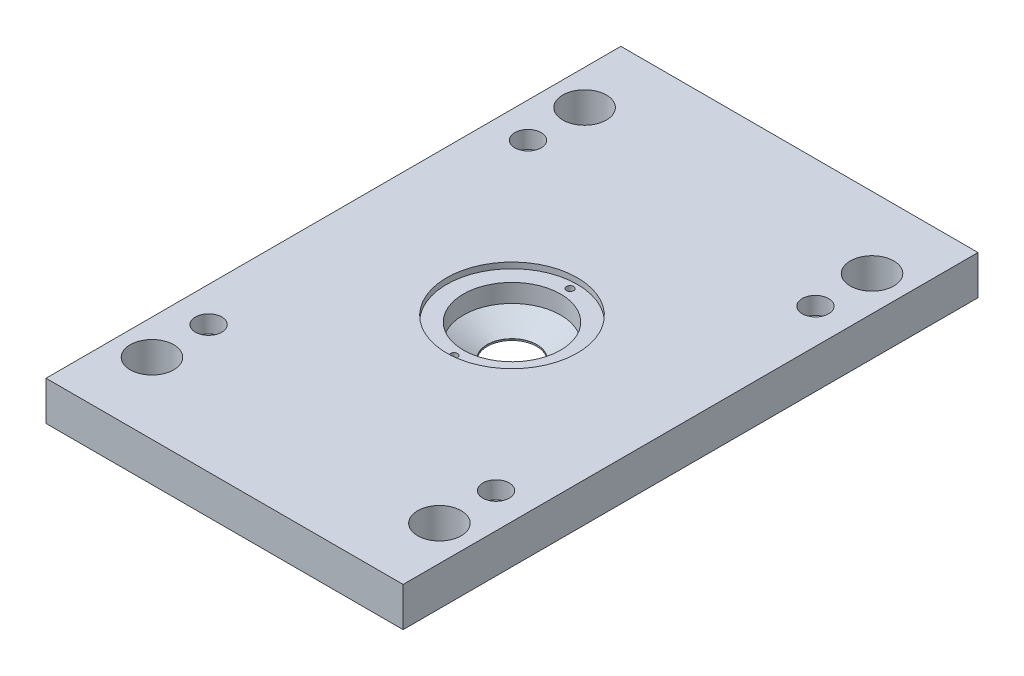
ISO-10303-21;
HEADER;
FILE_DESCRIPTION(('STEP AP214'),'2;1');
FILE_NAME('part.step','',(''),(''),'','','');
FILE_SCHEMA(('AUTOMOTIVE_DESIGN { 1 0 10303 214 1 1 1 1 }'));
ENDSEC;
DATA;
#1=APPLICATION_CONTEXT('core data for automotive mechanical design processes');
#2=APPLICATION_PROTOCOL_DEFINITION('international standard','automotive_design',2000,#1);
#3=PRODUCT_CONTEXT('',#1,'mechanical');
#4=PRODUCT('Part','Part','',(#3));
#5=PRODUCT_RELATED_PRODUCT_CATEGORY('part','',(#4));
#6=PRODUCT_DEFINITION_FORMATION('','',#4);
#7=PRODUCT_DEFINITION_CONTEXT('part definition',#1,'design');
#8=PRODUCT_DEFINITION('design','',#6,#7);
#9=PRODUCT_DEFINITION_SHAPE('','',#8);
#10=(LENGTH_UNIT() NAMED_UNIT(*) SI_UNIT(.MILLI.,.METRE.));
#11=(NAMED_UNIT(*) PLANE_ANGLE_UNIT() SI_UNIT($,.RADIAN.));
#12=(NAMED_UNIT(*) SI_UNIT($,.STERADIAN.) SOLID_ANGLE_UNIT());
#13=UNCERTAINTY_MEASURE_WITH_UNIT(LENGTH_MEASURE(1.E-05),#10,'distance_accuracy_value','');
#14=(GEOMETRIC_REPRESENTATION_CONTEXT(3) GLOBAL_UNCERTAINTY_ASSIGNED_CONTEXT((#13)) GLOBAL_UNIT_ASSIGNED_CONTEXT((#10,
#11,#12)) REPRESENTATION_CONTEXT('',''));
#15=CARTESIAN_POINT('',(0.,0.,0.));
#16=DIRECTION('',(0.,0.,1.));
#17=DIRECTION('',(1.,0.,0.));
#18=AXIS2_PLACEMENT_3D('',#15,#16,#17);
#19=CARTESIAN_POINT('',(-91.,79.5,65.));
#20=DIRECTION('',(-1.,0.,0.));
#21=DIRECTION('',(0.,0.,1.));
#22=AXIS2_PLACEMENT_3D('',#19,#20,#21);
#23=CONICAL_SURFACE('',#22,0.,1.0471975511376);
#24=CARTESIAN_POINT('',(-91.,79.5,65.));
#25=VERTEX_POINT('',#24);
#26=VERTEX_LOOP('',#25);
#27=FACE_BOUND('',#26,.T.);
#28=CARTESIAN_POINT('',(-93.95892013,79.5,65.));
#29=DIRECTION('',(1.,0.,0.));
#30=DIRECTION('',(0.,0.,-1.));
#31=AXIS2_PLACEMENT_3D('',#28,#29,#30);
#32=CIRCLE('',#31,5.125);
#33=CARTESIAN_POINT('',(-93.95892013,79.5,59.875));
#34=VERTEX_POINT('',#33);
#35=EDGE_CURVE('E70',#34,#34,#32,.T.);
#36=ORIENTED_EDGE('',*,*,#35,.F.);
#37=EDGE_LOOP('',(#36));
#38=FACE_BOUND('',#37,.T.);
#39=ADVANCED_FACE('F16',(#27,#38),#23,.F.);
#40=CARTESIAN_POINT('',(-99.,66.,-45.));
#41=DIRECTION('',(0.,1.,0.));
#42=DIRECTION('',(0.,0.,1.));
#43=AXIS2_PLACEMENT_3D('',#40,#41,#42);
#44=CYLINDRICAL_SURFACE('',#43,6.09999999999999);
#45=CARTESIAN_POINT('',(-99.,66.,-45.));
#46=DIRECTION('',(0.,1.,0.));
#47=DIRECTION('',(0.,0.,1.));
#48=AXIS2_PLACEMENT_3D('',#45,#46,#47);
#49=CIRCLE('',#48,6.09999999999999);
#50=CARTESIAN_POINT('',(-99.,66.,-38.9));
#51=VERTEX_POINT('',#50);
#52=EDGE_CURVE('E167',#51,#51,#49,.T.);
#53=ORIENTED_EDGE('',*,*,#52,.F.);
#54=EDGE_LOOP('',(#53));
#55=FACE_BOUND('',#54,.T.);
#56=CARTESIAN_POINT('',(-99.,81.,-45.));
#57=DIRECTION('',(0.,1.,0.));
#58=DIRECTION('',(0.,0.,1.));
#59=AXIS2_PLACEMENT_3D('',#56,#57,#58);
#60=CIRCLE('',#59,6.09999999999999);
#61=CARTESIAN_POINT('',(-99.,81.,-38.9));
#62=VERTEX_POINT('',#61);
#63=EDGE_CURVE('E20',#62,#62,#60,.T.);
#64=ORIENTED_EDGE('',*,*,#63,.T.);
#65=EDGE_LOOP('',(#64));
#66=FACE_BOUND('',#65,.T.);
#67=ADVANCED_FACE('F66',(#55,#66),#44,.F.);
#68=CARTESIAN_POINT('',(99.,66.,-45.));
#69=DIRECTION('',(0.,1.,0.));
#70=DIRECTION('',(0.,0.,1.));
#71=AXIS2_PLACEMENT_3D('',#68,#69,#70);
#72=CYLINDRICAL_SURFACE('',#71,6.09999999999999);
#73=CARTESIAN_POINT('',(99.,66.,-45.));
#74=DIRECTION('',(0.,1.,0.));
#75=DIRECTION('',(0.,0.,1.));
#76=AXIS2_PLACEMENT_3D('',#73,#74,#75);
#77=CIRCLE('',#76,6.09999999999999);
#78=CARTESIAN_POINT('',(99.,66.,-38.9));
#79=VERTEX_POINT('',#78);
#80=EDGE_CURVE('E164',#79,#79,#77,.T.);
#81=ORIENTED_EDGE('',*,*,#80,.F.);
#82=EDGE_LOOP('',(#81));
#83=FACE_BOUND('',#82,.T.);
#84=CARTESIAN_POINT('',(99.,81.,-45.));
#85=DIRECTION('',(0.,1.,0.));
#86=DIRECTION('',(0.,0.,1.));
#87=AXIS2_PLACEMENT_3D('',#84,#85,#86);
#88=CIRCLE('',#87,6.09999999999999);
#89=CARTESIAN_POINT('',(99.,81.,-38.9));
#90=VERTEX_POINT('',#89);
#91=EDGE_CURVE('E74',#90,#90,#88,.T.);
#92=ORIENTED_EDGE('',*,*,#91,.T.);
#93=EDGE_LOOP('',(#92));
#94=FACE_BOUND('',#93,.T.);
#95=ADVANCED_FACE('F178',(#83,#94),#72,.F.);
#96=CARTESIAN_POINT('',(-99.,66.,175.));
#97=DIRECTION('',(0.,1.,0.));
#98=DIRECTION('',(0.,0.,1.));
#99=AXIS2_PLACEMENT_3D('',#96,#97,#98);
#100=CYLINDRICAL_SURFACE('',#99,6.09999999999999);
#101=CARTESIAN_POINT('',(-99.,66.,175.));
#102=DIRECTION('',(0.,1.,0.));
#103=DIRECTION('',(0.,0.,1.));
#104=AXIS2_PLACEMENT_3D('',#101,#102,#103);
#105=CIRCLE('',#104,6.09999999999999);
#106=CARTESIAN_POINT('',(-99.,66.,181.1));
#107=VERTEX_POINT('',#106);
#108=EDGE_CURVE('E161',#107,#107,#105,.T.);
#109=ORIENTED_EDGE('',*,*,#108,.F.);
#110=EDGE_LOOP('',(#109));
#111=FACE_BOUND('',#110,.T.);
#112=CARTESIAN_POINT('',(-99.,81.,175.));
#113=DIRECTION('',(0.,1.,0.));
#114=DIRECTION('',(0.,0.,1.));
#115=AXIS2_PLACEMENT_3D('',#112,#113,#114);
#116=CIRCLE('',#115,6.09999999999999);
#117=CARTESIAN_POINT('',(-99.,81.,181.1));
#118=VERTEX_POINT('',#117);
#119=EDGE_CURVE('E173',#118,#118,#116,.T.);
#120=ORIENTED_EDGE('',*,*,#119,.T.);
#121=EDGE_LOOP('',(#120));
#122=FACE_BOUND('',#121,.T.);
#123=ADVANCED_FACE('F326',(#111,#122),#100,.F.);
#124=CARTESIAN_POINT('',(99.,66.,175.));
#125=DIRECTION('',(0.,1.,0.));
#126=DIRECTION('',(0.,0.,1.));
#127=AXIS2_PLACEMENT_3D('',#124,#125,#126);
#128=CYLINDRICAL_SURFACE('',#127,6.09999999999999);
#129=CARTESIAN_POINT('',(99.,66.,175.));
#130=DIRECTION('',(0.,1.,0.));
#131=DIRECTION('',(0.,0.,1.));
#132=AXIS2_PLACEMENT_3D('',#129,#130,#131);
#133=CIRCLE('',#132,6.09999999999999);
#134=CARTESIAN_POINT('',(99.,66.,181.1));
#135=VERTEX_POINT('',#134);
#136=EDGE_CURVE('E158',#135,#135,#133,.T.);
#137=ORIENTED_EDGE('',*,*,#136,.F.);
#138=EDGE_LOOP('',(#137));
#139=FACE_BOUND('',#138,.T.);
#140=CARTESIAN_POINT('',(99.,81.,175.));
#141=DIRECTION('',(0.,1.,0.));
#142=DIRECTION('',(0.,0.,1.));
#143=AXIS2_PLACEMENT_3D('',#140,#141,#142);
#144=CIRCLE('',#143,6.09999999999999);
#145=CARTESIAN_POINT('',(99.,81.,181.1));
#146=VERTEX_POINT('',#145);
#147=EDGE_CURVE('E170',#146,#146,#144,.T.);
#148=ORIENTED_EDGE('',*,*,#147,.T.);
#149=EDGE_LOOP('',(#148));
#150=FACE_BOUND('',#149,.T.);
#151=ADVANCED_FACE('F322',(#139,#150),#128,.F.);
#152=CARTESIAN_POINT('',(-123.,79.5,65.));
#153=DIRECTION('',(1.,0.,0.));
#154=DIRECTION('',(0.,1.,0.));
#155=AXIS2_PLACEMENT_3D('',#152,#153,#154);
#156=CYLINDRICAL_SURFACE('',#155,5.125);
#157=CARTESIAN_POINT('',(-123.,79.5,65.));
#158=DIRECTION('',(1.,0.,0.));
#159=DIRECTION('',(0.,1.,0.));
#160=AXIS2_PLACEMENT_3D('',#157,#158,#159);
#161=CIRCLE('',#160,5.125);
#162=CARTESIAN_POINT('',(-123.,84.625,65.));
#163=VERTEX_POINT('',#162);
#164=EDGE_CURVE('E151',#163,#163,#161,.F.);
#165=ORIENTED_EDGE('',*,*,#164,.T.);
#166=EDGE_LOOP('',(#165));
#167=FACE_BOUND('',#166,.T.);
#168=ORIENTED_EDGE('',*,*,#35,.T.);
#169=EDGE_LOOP('',(#168));
#170=FACE_BOUND('',#169,.T.);
#171=ADVANCED_FACE('F319',(#167,#170),#156,.F.);
#172=CARTESIAN_POINT('',(-89.7908,81.,-35.7908));
#173=DIRECTION('',(0.,-1.,0.));
#174=DIRECTION('',(-1.,0.,0.));
#175=AXIS2_PLACEMENT_3D('',#172,#173,#174);
#176=PLANE('',#175);
#177=ORIENTED_EDGE('',*,*,#63,.F.);
#178=EDGE_LOOP('',(#177));
#179=FACE_BOUND('',#178,.T.);
#180=CARTESIAN_POINT('',(-99.,81.,-45.));
#181=DIRECTION('',(0.,1.,0.));
#182=DIRECTION('',(0.,0.,1.));
#183=AXIS2_PLACEMENT_3D('',#180,#181,#182);
#184=CIRCLE('',#183,9.1);
#185=CARTESIAN_POINT('',(-99.,81.,-35.9));
#186=VERTEX_POINT('',#185);
#187=EDGE_CURVE('E144',#186,#186,#184,.F.);
#188=ORIENTED_EDGE('',*,*,#187,.F.);
#189=EDGE_LOOP('',(#188));
#190=FACE_BOUND('',#189,.T.);
#191=ADVANCED_FACE('F184',(#179,#190),#176,.F.);
#192=CARTESIAN_POINT('',(108.2092,81.,-35.7908));
#193=DIRECTION('',(0.,-1.,0.));
#194=DIRECTION('',(-1.,0.,0.));
#195=AXIS2_PLACEMENT_3D('',#192,#193,#194);
#196=PLANE('',#195);
#197=ORIENTED_EDGE('',*,*,#91,.F.);
#198=EDGE_LOOP('',(#197));
#199=FACE_BOUND('',#198,.T.);
#200=CARTESIAN_POINT('',(99.,81.,-45.));
#201=DIRECTION('',(0.,1.,0.));
#202=DIRECTION('',(0.,0.,1.));
#203=AXIS2_PLACEMENT_3D('',#200,#201,#202);
#204=CIRCLE('',#203,9.1);
#205=CARTESIAN_POINT('',(99.,81.,-35.9));
#206=VERTEX_POINT('',#205);
#207=EDGE_CURVE('E138',#206,#206,#204,.F.);
#208=ORIENTED_EDGE('',*,*,#207,.F.);
#209=EDGE_LOOP('',(#208));
#210=FACE_BOUND('',#209,.T.);
#211=ADVANCED_FACE('F180',(#199,#210),#196,.F.);
#212=CARTESIAN_POINT('',(-89.7908,81.,184.2092));
#213=DIRECTION('',(0.,-1.,0.));
#214=DIRECTION('',(-1.,0.,0.));
#215=AXIS2_PLACEMENT_3D('',#212,#213,#214);
#216=PLANE('',#215);
#217=ORIENTED_EDGE('',*,*,#119,.F.);
#218=EDGE_LOOP('',(#217));
#219=FACE_BOUND('',#218,.T.);
#220=CARTESIAN_POINT('',(-99.,81.,175.));
#221=DIRECTION('',(0.,1.,0.));
#222=DIRECTION('',(0.,0.,1.));
#223=AXIS2_PLACEMENT_3D('',#220,#221,#222);
#224=CIRCLE('',#223,9.1);
#225=CARTESIAN_POINT('',(-99.,81.,184.1));
#226=VERTEX_POINT('',#225);
#227=EDGE_CURVE('E135',#226,#226,#224,.F.);
#228=ORIENTED_EDGE('',*,*,#227,.F.);
#229=EDGE_LOOP('',(#228));
#230=FACE_BOUND('',#229,.T.);
#231=ADVANCED_FACE('F183',(#219,#230),#216,.F.);
#232=CARTESIAN_POINT('',(108.2092,81.,184.2092));
#233=DIRECTION('',(0.,-1.,0.));
#234=DIRECTION('',(-1.,0.,0.));
#235=AXIS2_PLACEMENT_3D('',#232,#233,#234);
#236=PLANE('',#235);
#237=ORIENTED_EDGE('',*,*,#147,.F.);
#238=EDGE_LOOP('',(#237));
#239=FACE_BOUND('',#238,.T.);
#240=CARTESIAN_POINT('',(99.,81.,175.));
#241=DIRECTION('',(0.,1.,0.));
#242=DIRECTION('',(0.,0.,1.));
#243=AXIS2_PLACEMENT_3D('',#240,#241,#242);
#244=CIRCLE('',#243,9.1);
#245=CARTESIAN_POINT('',(99.,81.,184.1));
#246=VERTEX_POINT('',#245);
#247=EDGE_CURVE('E129',#246,#246,#244,.F.);
#248=ORIENTED_EDGE('',*,*,#247,.F.);
#249=EDGE_LOOP('',(#248));
#250=FACE_BOUND('',#249,.T.);
#251=ADVANCED_FACE('F342',(#239,#250),#236,.F.);
#252=CARTESIAN_POINT('',(123.,66.,263.));
#253=DIRECTION('',(0.,-1.,0.));
#254=DIRECTION('',(-1.,0.,0.));
#255=AXIS2_PLACEMENT_3D('',#252,#253,#254);
#256=PLANE('',#255);
#257=ORIENTED_EDGE('',*,*,#136,.T.);
#258=EDGE_LOOP('',(#257));
#259=FACE_BOUND('',#258,.T.);
#260=CARTESIAN_POINT('',(99.,66.,214.));
#261=DIRECTION('',(0.,-1.,0.));
#262=DIRECTION('',(0.,0.,-1.));
#263=AXIS2_PLACEMENT_3D('',#260,#261,#262);
#264=CIRCLE('',#263,15.);
#265=CARTESIAN_POINT('',(99.,66.,199.));
#266=VERTEX_POINT('',#265);
#267=EDGE_CURVE('E126',#266,#266,#264,.T.);
#268=ORIENTED_EDGE('',*,*,#267,.F.);
#269=EDGE_LOOP('',(#268));
#270=FACE_BOUND('',#269,.T.);
#271=CARTESIAN_POINT('',(-99.,66.,214.));
#272=DIRECTION('',(0.,-1.,0.));
#273=DIRECTION('',(0.,0.,-1.));
#274=AXIS2_PLACEMENT_3D('',#271,#272,#273);
#275=CIRCLE('',#274,15.);
#276=CARTESIAN_POINT('',(-99.,66.,199.));
#277=VERTEX_POINT('',#276);
#278=EDGE_CURVE('E132',#277,#277,#275,.T.);
#279=ORIENTED_EDGE('',*,*,#278,.F.);
#280=EDGE_LOOP('',(#279));
#281=FACE_BOUND('',#280,.T.);
#282=ORIENTED_EDGE('',*,*,#108,.T.);
#283=EDGE_LOOP('',(#282));
#284=FACE_BOUND('',#283,.T.);
#285=ORIENTED_EDGE('',*,*,#80,.T.);
#286=EDGE_LOOP('',(#285));
#287=FACE_BOUND('',#286,.T.);
#288=CARTESIAN_POINT('',(99.,66.,-84.));
#289=DIRECTION('',(0.,-1.,0.));
#290=DIRECTION('',(0.,0.,-1.));
#291=AXIS2_PLACEMENT_3D('',#288,#289,#290);
#292=CIRCLE('',#291,15.);
#293=CARTESIAN_POINT('',(99.,66.,-99.));
#294=VERTEX_POINT('',#293);
#295=EDGE_CURVE('E141',#294,#294,#292,.T.);
#296=ORIENTED_EDGE('',*,*,#295,.F.);
#297=EDGE_LOOP('',(#296));
#298=FACE_BOUND('',#297,.T.);
#299=CARTESIAN_POINT('',(-99.,66.,-84.));
#300=DIRECTION('',(0.,-1.,0.));
#301=DIRECTION('',(0.,0.,-1.));
#302=AXIS2_PLACEMENT_3D('',#299,#300,#301);
#303=CIRCLE('',#302,15.);
#304=CARTESIAN_POINT('',(-99.,66.,-99.));
#305=VERTEX_POINT('',#304);
#306=EDGE_CURVE('E147',#305,#305,#303,.T.);
#307=ORIENTED_EDGE('',*,*,#306,.F.);
#308=EDGE_LOOP('',(#307));
#309=FACE_BOUND('',#308,.T.);
#310=ORIENTED_EDGE('',*,*,#52,.T.);
#311=EDGE_LOOP('',(#310));
#312=FACE_BOUND('',#311,.T.);
#313=CARTESIAN_POINT('',(0.,66.,65.));
#314=DIRECTION('',(0.,1.,0.));
#315=DIRECTION('',(0.,0.,1.));
#316=AXIS2_PLACEMENT_3D('',#313,#314,#315);
#317=CIRCLE('',#316,17.);
#318=CARTESIAN_POINT('',(0.,66.,82.));
#319=VERTEX_POINT('',#318);
#320=EDGE_CURVE('E155',#319,#319,#317,.F.);
#321=ORIENTED_EDGE('',*,*,#320,.F.);
#322=EDGE_LOOP('',(#321));
#323=FACE_BOUND('',#322,.T.);
#324=DIRECTION('',(0.,0.,-1.));
#325=VECTOR('',#324,1.);
#326=CARTESIAN_POINT('',(123.,66.,65.));
#327=LINE('',#326,#325);
#328=CARTESIAN_POINT('',(123.,66.,263.));
#329=VERTEX_POINT('',#328);
#330=CARTESIAN_POINT('',(123.,66.,-133.));
#331=VERTEX_POINT('',#330);
#332=EDGE_CURVE('E224',#329,#331,#327,.T.);
#333=ORIENTED_EDGE('',*,*,#332,.F.);
#334=DIRECTION('',(1.,0.,0.));
#335=VECTOR('',#334,1.);
#336=CARTESIAN_POINT('',(0.,66.,263.));
#337=LINE('',#336,#335);
#338=CARTESIAN_POINT('',(-123.,66.,263.));
#339=VERTEX_POINT('',#338);
#340=EDGE_CURVE('E242',#339,#329,#337,.T.);
#341=ORIENTED_EDGE('',*,*,#340,.F.);
#342=DIRECTION('',(0.,0.,-1.));
#343=VECTOR('',#342,1.);
#344=CARTESIAN_POINT('',(-123.,66.,65.));
#345=LINE('',#344,#343);
#346=CARTESIAN_POINT('',(-123.,66.,-133.));
#347=VERTEX_POINT('',#346);
#348=EDGE_CURVE('E60',#339,#347,#345,.T.);
#349=ORIENTED_EDGE('',*,*,#348,.T.);
#350=DIRECTION('',(-1.,0.,0.));
#351=VECTOR('',#350,1.);
#352=CARTESIAN_POINT('',(0.,66.,-133.));
#353=LINE('',#352,#351);
#354=EDGE_CURVE('E150',#331,#347,#353,.T.);
#355=ORIENTED_EDGE('',*,*,#354,.F.);
#356=EDGE_LOOP('',(#333,#341,#349,#355));
#357=FACE_BOUND('',#356,.T.);
#358=ADVANCED_FACE('F247',(#259,#270,#281,#284,#287,#298,#309,#312,#323,#357),#256,.T.);
#359=CARTESIAN_POINT('',(0.,66.,65.));
#360=DIRECTION('',(0.,1.,0.));
#361=DIRECTION('',(0.,0.,1.));
#362=AXIS2_PLACEMENT_3D('',#359,#360,#361);
#363=CYLINDRICAL_SURFACE('',#362,17.);
#364=ORIENTED_EDGE('',*,*,#320,.T.);
#365=EDGE_LOOP('',(#364));
#366=FACE_BOUND('',#365,.T.);
#367=CARTESIAN_POINT('',(0.,67.,65.));
#368=DIRECTION('',(0.,1.,0.));
#369=DIRECTION('',(0.,0.,1.));
#370=AXIS2_PLACEMENT_3D('',#367,#368,#369);
#371=CIRCLE('',#370,17.);
#372=CARTESIAN_POINT('',(0.,67.,82.));
#373=VERTEX_POINT('',#372);
#374=EDGE_CURVE('E122',#373,#373,#371,.T.);
#375=ORIENTED_EDGE('',*,*,#374,.T.);
#376=EDGE_LOOP('',(#375));
#377=FACE_BOUND('',#376,.T.);
#378=ADVANCED_FACE('F250',(#366,#377),#363,.F.);
#379=CARTESIAN_POINT('',(-123.,66.,263.));
#380=DIRECTION('',(1.,0.,0.));
#381=DIRECTION('',(0.,0.,-1.));
#382=AXIS2_PLACEMENT_3D('',#379,#380,#381);
#383=PLANE('',#382);
#384=ORIENTED_EDGE('',*,*,#164,.F.);
#385=EDGE_LOOP('',(#384));
#386=FACE_BOUND('',#385,.T.);
#387=DIRECTION('',(0.,0.,1.));
#388=VECTOR('',#387,1.);
#389=CARTESIAN_POINT('',(-123.,93.,65.));
#390=LINE('',#389,#388);
#391=CARTESIAN_POINT('',(-123.,93.,-133.));
#392=VERTEX_POINT('',#391);
#393=CARTESIAN_POINT('',(-123.,93.,263.));
#394=VERTEX_POINT('',#393);
#395=EDGE_CURVE('E125',#392,#394,#390,.T.);
#396=ORIENTED_EDGE('',*,*,#395,.F.);
#397=DIRECTION('',(0.,1.,0.));
#398=VECTOR('',#397,1.);
#399=CARTESIAN_POINT('',(-123.,79.5,-133.));
#400=LINE('',#399,#398);
#401=EDGE_CURVE('E228',#347,#392,#400,.T.);
#402=ORIENTED_EDGE('',*,*,#401,.F.);
#403=ORIENTED_EDGE('',*,*,#348,.F.);
#404=DIRECTION('',(0.,-1.,0.));
#405=VECTOR('',#404,1.);
#406=CARTESIAN_POINT('',(-123.,79.5,263.));
#407=LINE('',#406,#405);
#408=EDGE_CURVE('E154',#394,#339,#407,.T.);
#409=ORIENTED_EDGE('',*,*,#408,.F.);
#410=EDGE_LOOP('',(#396,#402,#403,#409));
#411=FACE_BOUND('',#410,.T.);
#412=ADVANCED_FACE('F248',(#386,#411),#383,.F.);
#413=CARTESIAN_POINT('',(-123.,93.,263.));
#414=DIRECTION('',(0.,0.,1.));
#415=DIRECTION('',(0.,-1.,0.));
#416=AXIS2_PLACEMENT_3D('',#413,#414,#415);
#417=PLANE('',#416);
#418=DIRECTION('',(0.,-1.,0.));
#419=VECTOR('',#418,1.);
#420=CARTESIAN_POINT('',(123.,79.5,263.));
#421=LINE('',#420,#419);
#422=CARTESIAN_POINT('',(123.,93.,263.));
#423=VERTEX_POINT('',#422);
#424=EDGE_CURVE('E240',#423,#329,#421,.T.);
#425=ORIENTED_EDGE('',*,*,#424,.F.);
#426=DIRECTION('',(1.,0.,0.));
#427=VECTOR('',#426,1.);
#428=CARTESIAN_POINT('',(0.,93.,263.));
#429=LINE('',#428,#427);
#430=EDGE_CURVE('E215',#394,#423,#429,.T.);
#431=ORIENTED_EDGE('',*,*,#430,.F.);
#432=ORIENTED_EDGE('',*,*,#408,.T.);
#433=ORIENTED_EDGE('',*,*,#340,.T.);
#434=EDGE_LOOP('',(#425,#431,#432,#433));
#435=FACE_BOUND('',#434,.T.);
#436=ADVANCED_FACE('F245',(#435),#417,.T.);
#437=CARTESIAN_POINT('',(123.,66.,263.));
#438=DIRECTION('',(1.,0.,0.));
#439=DIRECTION('',(0.,0.,-1.));
#440=AXIS2_PLACEMENT_3D('',#437,#438,#439);
#441=PLANE('',#440);
#442=DIRECTION('',(0.,-1.,0.));
#443=VECTOR('',#442,1.);
#444=CARTESIAN_POINT('',(123.,79.5,-133.));
#445=LINE('',#444,#443);
#446=CARTESIAN_POINT('',(123.,93.,-133.));
#447=VERTEX_POINT('',#446);
#448=EDGE_CURVE('E221',#447,#331,#445,.T.);
#449=ORIENTED_EDGE('',*,*,#448,.F.);
#450=DIRECTION('',(0.,0.,-1.));
#451=VECTOR('',#450,1.);
#452=CARTESIAN_POINT('',(123.,93.,65.));
#453=LINE('',#452,#451);
#454=EDGE_CURVE('E210',#423,#447,#453,.T.);
#455=ORIENTED_EDGE('',*,*,#454,.F.);
#456=ORIENTED_EDGE('',*,*,#424,.T.);
#457=ORIENTED_EDGE('',*,*,#332,.T.);
#458=EDGE_LOOP('',(#449,#455,#456,#457));
#459=FACE_BOUND('',#458,.T.);
#460=ADVANCED_FACE('F222',(#459),#441,.T.);
#461=CARTESIAN_POINT('',(-123.,66.,-133.));
#462=DIRECTION('',(0.,0.,-1.));
#463=DIRECTION('',(0.,1.,0.));
#464=AXIS2_PLACEMENT_3D('',#461,#462,#463);
#465=PLANE('',#464);
#466=ORIENTED_EDGE('',*,*,#448,.T.);
#467=ORIENTED_EDGE('',*,*,#354,.T.);
#468=ORIENTED_EDGE('',*,*,#401,.T.);
#469=DIRECTION('',(-1.,0.,0.));
#470=VECTOR('',#469,1.);
#471=CARTESIAN_POINT('',(0.,93.,-133.));
#472=LINE('',#471,#470);
#473=EDGE_CURVE('E121',#447,#392,#472,.T.);
#474=ORIENTED_EDGE('',*,*,#473,.F.);
#475=EDGE_LOOP('',(#466,#467,#468,#474));
#476=FACE_BOUND('',#475,.T.);
#477=ADVANCED_FACE('F230',(#476),#465,.T.);
#478=CARTESIAN_POINT('',(-99.,93.,-84.));
#479=DIRECTION('',(0.,-1.,0.));
#480=DIRECTION('',(0.,0.,-1.));
#481=AXIS2_PLACEMENT_3D('',#478,#479,#480);
#482=CYLINDRICAL_SURFACE('',#481,15.);
#483=CARTESIAN_POINT('',(-99.,93.,-84.));
#484=DIRECTION('',(0.,-1.,0.));
#485=DIRECTION('',(0.,0.,-1.));
#486=AXIS2_PLACEMENT_3D('',#483,#484,#485);
#487=CIRCLE('',#486,15.);
#488=CARTESIAN_POINT('',(-99.,93.,-99.));
#489=VERTEX_POINT('',#488);
#490=EDGE_CURVE('E118',#489,#489,#487,.T.);
#491=ORIENTED_EDGE('',*,*,#490,.F.);
#492=EDGE_LOOP('',(#491));
#493=FACE_BOUND('',#492,.T.);
#494=ORIENTED_EDGE('',*,*,#306,.T.);
#495=EDGE_LOOP('',(#494));
#496=FACE_BOUND('',#495,.T.);
#497=ADVANCED_FACE('F314',(#493,#496),#482,.F.);
#498=CARTESIAN_POINT('',(-99.,81.,-45.));
#499=DIRECTION('',(0.,1.,0.));
#500=DIRECTION('',(0.,0.,1.));
#501=AXIS2_PLACEMENT_3D('',#498,#499,#500);
#502=CYLINDRICAL_SURFACE('',#501,9.1);
#503=ORIENTED_EDGE('',*,*,#187,.T.);
#504=EDGE_LOOP('',(#503));
#505=FACE_BOUND('',#504,.T.);
#506=CARTESIAN_POINT('',(-99.,93.,-45.));
#507=DIRECTION('',(0.,1.,0.));
#508=DIRECTION('',(0.,0.,1.));
#509=AXIS2_PLACEMENT_3D('',#506,#507,#508);
#510=CIRCLE('',#509,9.1);
#511=CARTESIAN_POINT('',(-99.,93.,-35.9));
#512=VERTEX_POINT('',#511);
#513=EDGE_CURVE('E115',#512,#512,#510,.F.);
#514=ORIENTED_EDGE('',*,*,#513,.F.);
#515=EDGE_LOOP('',(#514));
#516=FACE_BOUND('',#515,.T.);
#517=ADVANCED_FACE('F310',(#505,#516),#502,.F.);
#518=CARTESIAN_POINT('',(99.,93.,-84.));
#519=DIRECTION('',(0.,-1.,0.));
#520=DIRECTION('',(0.,0.,-1.));
#521=AXIS2_PLACEMENT_3D('',#518,#519,#520);
#522=CYLINDRICAL_SURFACE('',#521,15.);
#523=CARTESIAN_POINT('',(99.,93.,-84.));
#524=DIRECTION('',(0.,-1.,0.));
#525=DIRECTION('',(0.,0.,-1.));
#526=AXIS2_PLACEMENT_3D('',#523,#524,#525);
#527=CIRCLE('',#526,15.);
#528=CARTESIAN_POINT('',(99.,93.,-99.));
#529=VERTEX_POINT('',#528);
#530=EDGE_CURVE('E112',#529,#529,#527,.T.);
#531=ORIENTED_EDGE('',*,*,#530,.F.);
#532=EDGE_LOOP('',(#531));
#533=FACE_BOUND('',#532,.T.);
#534=ORIENTED_EDGE('',*,*,#295,.T.);
#535=EDGE_LOOP('',(#534));
#536=FACE_BOUND('',#535,.T.);
#537=ADVANCED_FACE('F192',(#533,#536),#522,.F.);
#538=CARTESIAN_POINT('',(99.,81.,-45.));
#539=DIRECTION('',(0.,1.,0.));
#540=DIRECTION('',(0.,0.,1.));
#541=AXIS2_PLACEMENT_3D('',#538,#539,#540);
#542=CYLINDRICAL_SURFACE('',#541,9.1);
#543=ORIENTED_EDGE('',*,*,#207,.T.);
#544=EDGE_LOOP('',(#543));
#545=FACE_BOUND('',#544,.T.);
#546=CARTESIAN_POINT('',(99.,93.,-45.));
#547=DIRECTION('',(0.,1.,0.));
#548=DIRECTION('',(0.,0.,1.));
#549=AXIS2_PLACEMENT_3D('',#546,#547,#548);
#550=CIRCLE('',#549,9.1);
#551=CARTESIAN_POINT('',(99.,93.,-35.9));
#552=VERTEX_POINT('',#551);
#553=EDGE_CURVE('E109',#552,#552,#550,.F.);
#554=ORIENTED_EDGE('',*,*,#553,.F.);
#555=EDGE_LOOP('',(#554));
#556=FACE_BOUND('',#555,.T.);
#557=ADVANCED_FACE('F188',(#545,#556),#542,.F.);
#558=CARTESIAN_POINT('',(-99.,81.,175.));
#559=DIRECTION('',(0.,1.,0.));
#560=DIRECTION('',(0.,0.,1.));
#561=AXIS2_PLACEMENT_3D('',#558,#559,#560);
#562=CYLINDRICAL_SURFACE('',#561,9.1);
#563=ORIENTED_EDGE('',*,*,#227,.T.);
#564=EDGE_LOOP('',(#563));
#565=FACE_BOUND('',#564,.T.);
#566=CARTESIAN_POINT('',(-99.,93.,175.));
#567=DIRECTION('',(0.,1.,0.));
#568=DIRECTION('',(0.,0.,1.));
#569=AXIS2_PLACEMENT_3D('',#566,#567,#568);
#570=CIRCLE('',#569,9.1);
#571=CARTESIAN_POINT('',(-99.,93.,184.1));
#572=VERTEX_POINT('',#571);
#573=EDGE_CURVE('E106',#572,#572,#570,.F.);
#574=ORIENTED_EDGE('',*,*,#573,.F.);
#575=EDGE_LOOP('',(#574));
#576=FACE_BOUND('',#575,.T.);
#577=ADVANCED_FACE('F191',(#565,#576),#562,.F.);
#578=CARTESIAN_POINT('',(-99.,93.,214.));
#579=DIRECTION('',(0.,-1.,0.));
#580=DIRECTION('',(0.,0.,-1.));
#581=AXIS2_PLACEMENT_3D('',#578,#579,#580);
#582=CYLINDRICAL_SURFACE('',#581,15.);
#583=CARTESIAN_POINT('',(-99.,93.,214.));
#584=DIRECTION('',(0.,-1.,0.));
#585=DIRECTION('',(0.,0.,-1.));
#586=AXIS2_PLACEMENT_3D('',#583,#584,#585);
#587=CIRCLE('',#586,15.);
#588=CARTESIAN_POINT('',(-99.,93.,199.));
#589=VERTEX_POINT('',#588);
#590=EDGE_CURVE('E103',#589,#589,#587,.T.);
#591=ORIENTED_EDGE('',*,*,#590,.F.);
#592=EDGE_LOOP('',(#591));
#593=FACE_BOUND('',#592,.T.);
#594=ORIENTED_EDGE('',*,*,#278,.T.);
#595=EDGE_LOOP('',(#594));
#596=FACE_BOUND('',#595,.T.);
#597=ADVANCED_FACE('F300',(#593,#596),#582,.F.);
#598=CARTESIAN_POINT('',(99.,81.,175.));
#599=DIRECTION('',(0.,1.,0.));
#600=DIRECTION('',(0.,0.,1.));
#601=AXIS2_PLACEMENT_3D('',#598,#599,#600);
#602=CYLINDRICAL_SURFACE('',#601,9.1);
#603=ORIENTED_EDGE('',*,*,#247,.T.);
#604=EDGE_LOOP('',(#603));
#605=FACE_BOUND('',#604,.T.);
#606=CARTESIAN_POINT('',(99.,93.,175.));
#607=DIRECTION('',(0.,1.,0.));
#608=DIRECTION('',(0.,0.,1.));
#609=AXIS2_PLACEMENT_3D('',#606,#607,#608);
#610=CIRCLE('',#609,9.1);
#611=CARTESIAN_POINT('',(99.,93.,184.1));
#612=VERTEX_POINT('',#611);
#613=EDGE_CURVE('E100',#612,#612,#610,.F.);
#614=ORIENTED_EDGE('',*,*,#613,.F.);
#615=EDGE_LOOP('',(#614));
#616=FACE_BOUND('',#615,.T.);
#617=ADVANCED_FACE('F296',(#605,#616),#602,.F.);
#618=CARTESIAN_POINT('',(99.,93.,214.));
#619=DIRECTION('',(0.,-1.,0.));
#620=DIRECTION('',(0.,0.,-1.));
#621=AXIS2_PLACEMENT_3D('',#618,#619,#620);
#622=CYLINDRICAL_SURFACE('',#621,15.);
#623=CARTESIAN_POINT('',(99.,93.,214.));
#624=DIRECTION('',(0.,-1.,0.));
#625=DIRECTION('',(0.,0.,-1.));
#626=AXIS2_PLACEMENT_3D('',#623,#624,#625);
#627=CIRCLE('',#626,15.);
#628=CARTESIAN_POINT('',(99.,93.,199.));
#629=VERTEX_POINT('',#628);
#630=EDGE_CURVE('E97',#629,#629,#627,.T.);
#631=ORIENTED_EDGE('',*,*,#630,.F.);
#632=EDGE_LOOP('',(#631));
#633=FACE_BOUND('',#632,.T.);
#634=ORIENTED_EDGE('',*,*,#267,.T.);
#635=EDGE_LOOP('',(#634));
#636=FACE_BOUND('',#635,.T.);
#637=ADVANCED_FACE('F293',(#633,#636),#622,.F.);
#638=CARTESIAN_POINT('',(17.349316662,67.,82.349316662));
#639=DIRECTION('',(0.,-1.,0.));
#640=DIRECTION('',(-1.,0.,0.));
#641=AXIS2_PLACEMENT_3D('',#638,#639,#640);
#642=PLANE('',#641);
#643=ORIENTED_EDGE('',*,*,#374,.F.);
#644=EDGE_LOOP('',(#643));
#645=FACE_BOUND('',#644,.T.);
#646=CARTESIAN_POINT('',(0.,67.,65.));
#647=DIRECTION('',(0.,1.,0.));
#648=DIRECTION('',(0.,0.,1.));
#649=AXIS2_PLACEMENT_3D('',#646,#647,#648);
#650=CIRCLE('',#649,17.143593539);
#651=CARTESIAN_POINT('',(0.,67.,82.143593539));
#652=VERTEX_POINT('',#651);
#653=EDGE_CURVE('E94',#652,#652,#650,.F.);
#654=ORIENTED_EDGE('',*,*,#653,.F.);
#655=EDGE_LOOP('',(#654));
#656=FACE_BOUND('',#655,.T.);
#657=ADVANCED_FACE('F200',(#645,#656),#642,.F.);
#658=CARTESIAN_POINT('',(-123.,93.,263.));
#659=DIRECTION('',(0.,1.,0.));
#660=DIRECTION('',(1.,0.,0.));
#661=AXIS2_PLACEMENT_3D('',#658,#659,#660);
#662=PLANE('',#661);
#663=ORIENTED_EDGE('',*,*,#630,.T.);
#664=EDGE_LOOP('',(#663));
#665=FACE_BOUND('',#664,.T.);
#666=ORIENTED_EDGE('',*,*,#613,.T.);
#667=EDGE_LOOP('',(#666));
#668=FACE_BOUND('',#667,.T.);
#669=ORIENTED_EDGE('',*,*,#590,.T.);
#670=EDGE_LOOP('',(#669));
#671=FACE_BOUND('',#670,.T.);
#672=ORIENTED_EDGE('',*,*,#573,.T.);
#673=EDGE_LOOP('',(#672));
#674=FACE_BOUND('',#673,.T.);
#675=CARTESIAN_POINT('',(0.,93.,65.));
#676=DIRECTION('',(0.,-1.,0.));
#677=DIRECTION('',(0.,0.,-1.));
#678=AXIS2_PLACEMENT_3D('',#675,#676,#677);
#679=CIRCLE('',#678,45.);
#680=CARTESIAN_POINT('',(0.,93.,20.));
#681=VERTEX_POINT('',#680);
#682=EDGE_CURVE('E90',#681,#681,#679,.F.);
#683=ORIENTED_EDGE('',*,*,#682,.F.);
#684=EDGE_LOOP('',(#683));
#685=FACE_BOUND('',#684,.T.);
#686=ORIENTED_EDGE('',*,*,#553,.T.);
#687=EDGE_LOOP('',(#686));
#688=FACE_BOUND('',#687,.T.);
#689=ORIENTED_EDGE('',*,*,#530,.T.);
#690=EDGE_LOOP('',(#689));
#691=FACE_BOUND('',#690,.T.);
#692=ORIENTED_EDGE('',*,*,#513,.T.);
#693=EDGE_LOOP('',(#692));
#694=FACE_BOUND('',#693,.T.);
#695=ORIENTED_EDGE('',*,*,#490,.T.);
#696=EDGE_LOOP('',(#695));
#697=FACE_BOUND('',#696,.T.);
#698=ORIENTED_EDGE('',*,*,#454,.T.);
#699=ORIENTED_EDGE('',*,*,#473,.T.);
#700=ORIENTED_EDGE('',*,*,#395,.T.);
#701=ORIENTED_EDGE('',*,*,#430,.T.);
#702=EDGE_LOOP('',(#698,#699,#700,#701));
#703=FACE_BOUND('',#702,.T.);
#704=ADVANCED_FACE('F196',(#665,#668,#671,#674,#685,#688,#691,#694,#697,#703),#662,.T.);
#705=CARTESIAN_POINT('',(0.,70.056624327,25.));
#706=DIRECTION('',(0.,1.,0.));
#707=DIRECTION('',(0.,0.,1.));
#708=AXIS2_PLACEMENT_3D('',#705,#706,#707);
#709=CONICAL_SURFACE('',#708,0.,1.04719755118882);
#710=CARTESIAN_POINT('',(0.,70.056624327,25.));
#711=VERTEX_POINT('',#710);
#712=VERTEX_LOOP('',#711);
#713=FACE_BOUND('',#712,.T.);
#714=CARTESIAN_POINT('',(0.,71.5,25.));
#715=DIRECTION('',(0.,1.,0.));
#716=DIRECTION('',(1.,0.,0.));
#717=AXIS2_PLACEMENT_3D('',#714,#715,#716);
#718=CIRCLE('',#717,2.5);
#719=CARTESIAN_POINT('',(2.5,71.5,25.));
#720=VERTEX_POINT('',#719);
#721=EDGE_CURVE('E93',#720,#720,#718,.F.);
#722=ORIENTED_EDGE('',*,*,#721,.F.);
#723=EDGE_LOOP('',(#722));
#724=FACE_BOUND('',#723,.T.);
#725=ADVANCED_FACE('F199',(#713,#724),#709,.F.);
#726=CARTESIAN_POINT('',(0.,67.,65.));
#727=DIRECTION('',(0.,1.,0.));
#728=DIRECTION('',(0.,0.,1.));
#729=AXIS2_PLACEMENT_3D('',#726,#727,#728);
#730=CONICAL_SURFACE('',#729,17.143593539,1.04719755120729);
#731=CARTESIAN_POINT('',(0.,76.443375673,65.));
#732=DIRECTION('',(0.,-1.,0.));
#733=DIRECTION('',(-1.,0.,0.));
#734=AXIS2_PLACEMENT_3D('',#731,#732,#733);
#735=CIRCLE('',#734,33.5);
#736=CARTESIAN_POINT('',(-33.5,76.443375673,65.));
#737=VERTEX_POINT('',#736);
#738=EDGE_CURVE('E89',#737,#737,#735,.T.);
#739=ORIENTED_EDGE('',*,*,#738,.F.);
#740=EDGE_LOOP('',(#739));
#741=FACE_BOUND('',#740,.T.);
#742=ORIENTED_EDGE('',*,*,#653,.T.);
#743=EDGE_LOOP('',(#742));
#744=FACE_BOUND('',#743,.T.);
#745=ADVANCED_FACE('F285',(#741,#744),#730,.F.);
#746=CARTESIAN_POINT('',(0.,93.,65.));
#747=DIRECTION('',(0.,-1.,0.));
#748=DIRECTION('',(0.,0.,-1.));
#749=AXIS2_PLACEMENT_3D('',#746,#747,#748);
#750=CYLINDRICAL_SURFACE('',#749,45.);
#751=CARTESIAN_POINT('',(0.,89.,65.));
#752=DIRECTION('',(0.,-1.,0.));
#753=DIRECTION('',(0.,0.,-1.));
#754=AXIS2_PLACEMENT_3D('',#751,#752,#753);
#755=CIRCLE('',#754,45.);
#756=CARTESIAN_POINT('',(0.,89.,20.));
#757=VERTEX_POINT('',#756);
#758=EDGE_CURVE('E86',#757,#757,#755,.T.);
#759=ORIENTED_EDGE('',*,*,#758,.T.);
#760=EDGE_LOOP('',(#759));
#761=FACE_BOUND('',#760,.T.);
#762=ORIENTED_EDGE('',*,*,#682,.T.);
#763=EDGE_LOOP('',(#762));
#764=FACE_BOUND('',#763,.T.);
#765=ADVANCED_FACE('F281',(#761,#764),#750,.F.);
#766=CARTESIAN_POINT('',(0.,71.5,25.));
#767=DIRECTION('',(0.,1.,0.));
#768=DIRECTION('',(0.,0.,1.));
#769=AXIS2_PLACEMENT_3D('',#766,#767,#768);
#770=CYLINDRICAL_SURFACE('',#769,2.5);
#771=CARTESIAN_POINT('',(0.,89.,25.));
#772=DIRECTION('',(0.,1.,0.));
#773=DIRECTION('',(0.,0.,1.));
#774=AXIS2_PLACEMENT_3D('',#771,#772,#773);
#775=CIRCLE('',#774,2.5);
#776=CARTESIAN_POINT('',(0.,89.,27.5));
#777=VERTEX_POINT('',#776);
#778=EDGE_CURVE('E83',#777,#777,#775,.T.);
#779=ORIENTED_EDGE('',*,*,#778,.T.);
#780=EDGE_LOOP('',(#779));
#781=FACE_BOUND('',#780,.T.);
#782=ORIENTED_EDGE('',*,*,#721,.T.);
#783=EDGE_LOOP('',(#782));
#784=FACE_BOUND('',#783,.T.);
#785=ADVANCED_FACE('F277',(#781,#784),#770,.F.);
#786=CARTESIAN_POINT('',(0.,89.,65.));
#787=DIRECTION('',(0.,-1.,0.));
#788=DIRECTION('',(0.,0.,-1.));
#789=AXIS2_PLACEMENT_3D('',#786,#787,#788);
#790=CYLINDRICAL_SURFACE('',#789,33.5);
#791=ORIENTED_EDGE('',*,*,#738,.T.);
#792=EDGE_LOOP('',(#791));
#793=FACE_BOUND('',#792,.T.);
#794=CARTESIAN_POINT('',(0.,89.,65.));
#795=DIRECTION('',(0.,-1.,0.));
#796=DIRECTION('',(0.,0.,-1.));
#797=AXIS2_PLACEMENT_3D('',#794,#795,#796);
#798=CIRCLE('',#797,33.5);
#799=CARTESIAN_POINT('',(0.,89.,31.5));
#800=VERTEX_POINT('',#799);
#801=EDGE_CURVE('E80',#800,#800,#798,.F.);
#802=ORIENTED_EDGE('',*,*,#801,.T.);
#803=EDGE_LOOP('',(#802));
#804=FACE_BOUND('',#803,.T.);
#805=ADVANCED_FACE('F274',(#793,#804),#790,.F.);
#806=CARTESIAN_POINT('',(-45.54,89.,19.46));
#807=DIRECTION('',(0.,-1.,0.));
#808=DIRECTION('',(1.,0.,0.));
#809=AXIS2_PLACEMENT_3D('',#806,#807,#808);
#810=PLANE('',#809);
#811=ORIENTED_EDGE('',*,*,#801,.F.);
#812=EDGE_LOOP('',(#811));
#813=FACE_BOUND('',#812,.T.);
#814=ORIENTED_EDGE('',*,*,#778,.F.);
#815=EDGE_LOOP('',(#814));
#816=FACE_BOUND('',#815,.T.);
#817=CARTESIAN_POINT('',(0.,89.,105.));
#818=DIRECTION('',(0.,1.,0.));
#819=DIRECTION('',(0.,0.,1.));
#820=AXIS2_PLACEMENT_3D('',#817,#818,#819);
#821=CIRCLE('',#820,2.5);
#822=CARTESIAN_POINT('',(0.,89.,107.5));
#823=VERTEX_POINT('',#822);
#824=EDGE_CURVE('E26',#823,#823,#821,.T.);
#825=ORIENTED_EDGE('',*,*,#824,.F.);
#826=EDGE_LOOP('',(#825));
#827=FACE_BOUND('',#826,.T.);
#828=ORIENTED_EDGE('',*,*,#758,.F.);
#829=EDGE_LOOP('',(#828));
#830=FACE_BOUND('',#829,.T.);
#831=ADVANCED_FACE('F18',(#813,#816,#827,#830),#810,.F.);
#832=CARTESIAN_POINT('',(0.,71.5,105.));
#833=DIRECTION('',(0.,1.,0.));
#834=DIRECTION('',(0.,0.,1.));
#835=AXIS2_PLACEMENT_3D('',#832,#833,#834);
#836=CYLINDRICAL_SURFACE('',#835,2.5);
#837=CARTESIAN_POINT('',(0.,71.5,105.));
#838=DIRECTION('',(0.,1.,0.));
#839=DIRECTION('',(-1.,0.,0.));
#840=AXIS2_PLACEMENT_3D('',#837,#838,#839);
#841=CIRCLE('',#840,2.5);
#842=CARTESIAN_POINT('',(-2.5,71.5,105.));
#843=VERTEX_POINT('',#842);
#844=EDGE_CURVE('E11',#843,#843,#841,.T.);
#845=ORIENTED_EDGE('',*,*,#844,.F.);
#846=EDGE_LOOP('',(#845));
#847=FACE_BOUND('',#846,.T.);
#848=ORIENTED_EDGE('',*,*,#824,.T.);
#849=EDGE_LOOP('',(#848));
#850=FACE_BOUND('',#849,.T.);
#851=ADVANCED_FACE('F265',(#847,#850),#836,.F.);
#852=CARTESIAN_POINT('',(0.,70.056624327,105.));
#853=DIRECTION('',(0.,1.,0.));
#854=DIRECTION('',(0.,0.,1.));
#855=AXIS2_PLACEMENT_3D('',#852,#853,#854);
#856=CONICAL_SURFACE('',#855,0.,1.04719755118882);
#857=CARTESIAN_POINT('',(0.,70.056624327,105.));
#858=VERTEX_POINT('',#857);
#859=VERTEX_LOOP('',#858);
#860=FACE_BOUND('',#859,.T.);
#861=ORIENTED_EDGE('',*,*,#844,.T.);
#862=EDGE_LOOP('',(#861));
#863=FACE_BOUND('',#862,.T.);
#864=ADVANCED_FACE('F263',(#860,#863),#856,.F.);
#865=CLOSED_SHELL('',(#39,#67,#95,#123,#151,#171,#191,#211,#231,#251,#358,#378,#412,#436,#460,
#477,#497,#517,#537,#557,#577,#597,#617,#637,#657,#704,#725,#745,#765,#785,#805,#831,#851,#864));
#866=MANIFOLD_SOLID_BREP('B1',#865);
#867=ADVANCED_BREP_SHAPE_REPRESENTATION('',(#18,#866),#14);
#868=SHAPE_DEFINITION_REPRESENTATION(#9,#867);
ENDSEC;
END-ISO-10303-21;
